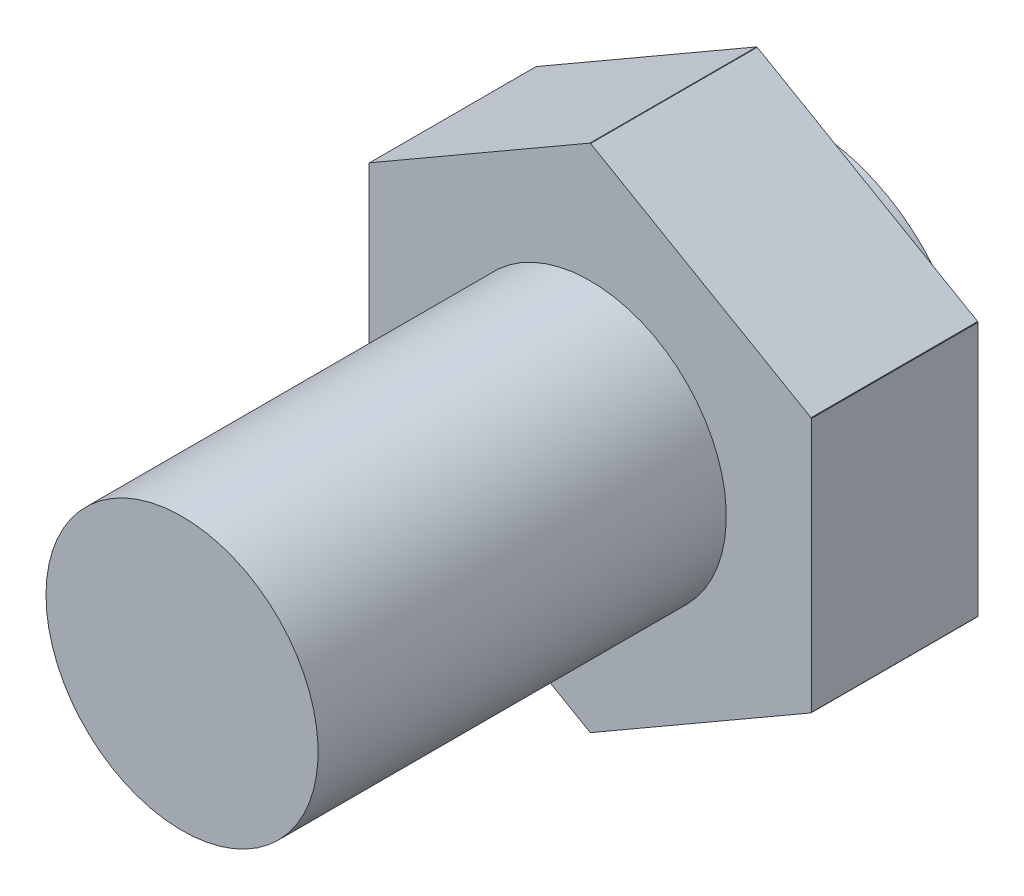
ISO-10303-21;
HEADER;
FILE_DESCRIPTION(('STEP AP214'),'2;1');
FILE_NAME('part.step','',(''),(''),'','','');
FILE_SCHEMA(('AUTOMOTIVE_DESIGN { 1 0 10303 214 1 1 1 1 }'));
ENDSEC;
DATA;
#1=APPLICATION_CONTEXT('core data for automotive mechanical design processes');
#2=APPLICATION_PROTOCOL_DEFINITION('international standard','automotive_design',2000,#1);
#3=PRODUCT_CONTEXT('',#1,'mechanical');
#4=PRODUCT('Part','Part','',(#3));
#5=PRODUCT_RELATED_PRODUCT_CATEGORY('part','',(#4));
#6=PRODUCT_DEFINITION_FORMATION('','',#4);
#7=PRODUCT_DEFINITION_CONTEXT('part definition',#1,'design');
#8=PRODUCT_DEFINITION('design','',#6,#7);
#9=PRODUCT_DEFINITION_SHAPE('','',#8);
#10=(LENGTH_UNIT() NAMED_UNIT(*) SI_UNIT(.MILLI.,.METRE.));
#11=(NAMED_UNIT(*) PLANE_ANGLE_UNIT() SI_UNIT($,.RADIAN.));
#12=(NAMED_UNIT(*) SI_UNIT($,.STERADIAN.) SOLID_ANGLE_UNIT());
#13=UNCERTAINTY_MEASURE_WITH_UNIT(LENGTH_MEASURE(1.E-05),#10,'distance_accuracy_value','');
#14=(GEOMETRIC_REPRESENTATION_CONTEXT(3) GLOBAL_UNCERTAINTY_ASSIGNED_CONTEXT((#13)) GLOBAL_UNIT_ASSIGNED_CONTEXT((#10,
#11,#12)) REPRESENTATION_CONTEXT('',''));
#15=CARTESIAN_POINT('',(0.,0.,0.));
#16=DIRECTION('',(0.,0.,1.));
#17=DIRECTION('',(1.,0.,0.));
#18=AXIS2_PLACEMENT_3D('',#15,#16,#17);
#19=CARTESIAN_POINT('',(-4.,0.,6.4));
#20=DIRECTION('',(0.,0.,-1.));
#21=DIRECTION('',(-1.,0.,0.));
#22=AXIS2_PLACEMENT_3D('',#19,#20,#21);
#23=PLANE('',#22);
#24=CARTESIAN_POINT('',(0.,0.,6.4));
#25=DIRECTION('',(0.,0.,-1.));
#26=DIRECTION('',(-1.,0.,0.));
#27=AXIS2_PLACEMENT_3D('',#24,#25,#26);
#28=CIRCLE('',#27,4.);
#29=CARTESIAN_POINT('',(-4.,0.,6.4));
#30=VERTEX_POINT('',#29);
#31=EDGE_CURVE('E131',#30,#30,#28,.T.);
#32=ORIENTED_EDGE('',*,*,#31,.T.);
#33=EDGE_LOOP('',(#32));
#34=FACE_BOUND('',#33,.T.);
#35=CARTESIAN_POINT('',(0.,0.,6.4));
#36=DIRECTION('',(0.,0.,-1.));
#37=DIRECTION('',(-1.,0.,0.));
#38=AXIS2_PLACEMENT_3D('',#35,#36,#37);
#39=CIRCLE('',#38,7.5);
#40=CARTESIAN_POINT('',(-0.00962965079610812,7.49999381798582,6.4));
#41=VERTEX_POINT('',#40);
#42=CARTESIAN_POINT('',(0.00962965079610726,7.49999381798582,6.4));
#43=VERTEX_POINT('',#42);
#44=EDGE_CURVE('E132',#41,#43,#39,.T.);
#45=ORIENTED_EDGE('',*,*,#44,.F.);
#46=DIRECTION('',(-0.866025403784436,-0.5,0.));
#47=VECTOR('',#46,1.);
#48=CARTESIAN_POINT('',(-6.25,3.89711431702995,6.4));
#49=LINE('',#48,#47);
#50=CARTESIAN_POINT('',(-6.49037034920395,3.75833643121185,6.4));
#51=VERTEX_POINT('',#50);
#52=EDGE_CURVE('E116',#41,#51,#49,.T.);
#53=ORIENTED_EDGE('',*,*,#52,.T.);
#54=CARTESIAN_POINT('',(-6.5,3.74165738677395,6.4));
#55=VERTEX_POINT('',#54);
#56=EDGE_CURVE('E128',#55,#51,#39,.T.);
#57=ORIENTED_EDGE('',*,*,#56,.F.);
#58=DIRECTION('',(0.,-1.,0.));
#59=VECTOR('',#58,1.);
#60=CARTESIAN_POINT('',(-6.5,0.,6.4));
#61=LINE('',#60,#59);
#62=CARTESIAN_POINT('',(-6.5,-3.74165738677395,6.4));
#63=VERTEX_POINT('',#62);
#64=EDGE_CURVE('E122',#55,#63,#61,.T.);
#65=ORIENTED_EDGE('',*,*,#64,.T.);
#66=CARTESIAN_POINT('',(-6.49037034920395,-3.75833643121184,6.4));
#67=VERTEX_POINT('',#66);
#68=EDGE_CURVE('E127',#67,#63,#39,.T.);
#69=ORIENTED_EDGE('',*,*,#68,.F.);
#70=DIRECTION('',(-0.866025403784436,0.5,0.));
#71=VECTOR('',#70,1.);
#72=CARTESIAN_POINT('',(-6.25,-3.89711431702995,6.4));
#73=LINE('',#72,#71);
#74=CARTESIAN_POINT('',(-0.00962965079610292,-7.49999381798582,6.4));
#75=VERTEX_POINT('',#74);
#76=EDGE_CURVE('E248',#75,#67,#73,.T.);
#77=ORIENTED_EDGE('',*,*,#76,.F.);
#78=CARTESIAN_POINT('',(0.00962965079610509,-7.49999381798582,6.4));
#79=VERTEX_POINT('',#78);
#80=EDGE_CURVE('E263',#79,#75,#39,.T.);
#81=ORIENTED_EDGE('',*,*,#80,.F.);
#82=DIRECTION('',(0.866025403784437,0.5,0.));
#83=VECTOR('',#82,1.);
#84=CARTESIAN_POINT('',(0.25000000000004,-7.36121593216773,6.4));
#85=LINE('',#84,#83);
#86=CARTESIAN_POINT('',(6.49037034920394,-3.75833643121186,6.4));
#87=VERTEX_POINT('',#86);
#88=EDGE_CURVE('E240',#79,#87,#85,.T.);
#89=ORIENTED_EDGE('',*,*,#88,.T.);
#90=CARTESIAN_POINT('',(6.5,-3.74165738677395,6.4));
#91=VERTEX_POINT('',#90);
#92=EDGE_CURVE('E265',#91,#87,#39,.T.);
#93=ORIENTED_EDGE('',*,*,#92,.F.);
#94=DIRECTION('',(0.,-1.,0.));
#95=VECTOR('',#94,1.);
#96=CARTESIAN_POINT('',(6.5,0.,6.4));
#97=LINE('',#96,#95);
#98=CARTESIAN_POINT('',(6.5,3.74165738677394,6.4));
#99=VERTEX_POINT('',#98);
#100=EDGE_CURVE('E233',#99,#91,#97,.T.);
#101=ORIENTED_EDGE('',*,*,#100,.F.);
#102=CARTESIAN_POINT('',(6.49037034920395,3.75833643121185,6.4));
#103=VERTEX_POINT('',#102);
#104=EDGE_CURVE('E270',#103,#99,#39,.T.);
#105=ORIENTED_EDGE('',*,*,#104,.F.);
#106=DIRECTION('',(0.866025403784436,-0.5,0.));
#107=VECTOR('',#106,1.);
#108=CARTESIAN_POINT('',(0.250000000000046,7.36121593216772,6.4));
#109=LINE('',#108,#107);
#110=EDGE_CURVE('E226',#43,#103,#109,.T.);
#111=ORIENTED_EDGE('',*,*,#110,.F.);
#112=EDGE_LOOP('',(#45,#53,#57,#65,#69,#77,#81,#89,#93,#101,#105,#111));
#113=FACE_BOUND('',#112,.T.);
#114=ADVANCED_FACE('F15',(#34,#113),#23,.F.);
#115=CARTESIAN_POINT('',(0.,0.,-51.6));
#116=DIRECTION('',(0.,0.,-1.));
#117=DIRECTION('',(-1.,0.,0.));
#118=AXIS2_PLACEMENT_3D('',#115,#116,#117);
#119=CYLINDRICAL_SURFACE('',#118,7.5);
#120=DIRECTION('',(0.,0.,-1.));
#121=VECTOR('',#120,1.);
#122=CARTESIAN_POINT('',(-6.49037034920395,3.75833643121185,-51.6));
#123=LINE('',#122,#121);
#124=CARTESIAN_POINT('',(-6.49037034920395,3.75833643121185,1.5));
#125=VERTEX_POINT('',#124);
#126=EDGE_CURVE('E37',#51,#125,#123,.T.);
#127=ORIENTED_EDGE('',*,*,#126,.T.);
#128=CARTESIAN_POINT('',(0.,0.,1.5));
#129=DIRECTION('',(0.,0.,1.));
#130=DIRECTION('',(1.,0.,0.));
#131=AXIS2_PLACEMENT_3D('',#128,#129,#130);
#132=CIRCLE('',#131,7.5);
#133=CARTESIAN_POINT('',(-6.5,3.74165738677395,1.5));
#134=VERTEX_POINT('',#133);
#135=EDGE_CURVE('E31',#125,#134,#132,.T.);
#136=ORIENTED_EDGE('',*,*,#135,.T.);
#137=DIRECTION('',(0.,0.,-1.));
#138=VECTOR('',#137,1.);
#139=CARTESIAN_POINT('',(-6.5,3.74165738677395,-51.6));
#140=LINE('',#139,#138);
#141=EDGE_CURVE('E253',#134,#55,#140,.F.);
#142=ORIENTED_EDGE('',*,*,#141,.T.);
#143=ORIENTED_EDGE('',*,*,#56,.T.);
#144=EDGE_LOOP('',(#127,#136,#142,#143));
#145=FACE_BOUND('',#144,.T.);
#146=ADVANCED_FACE('F152',(#145),#119,.T.);
#147=DIRECTION('',(0.,0.,-1.));
#148=VECTOR('',#147,1.);
#149=CARTESIAN_POINT('',(-6.5,-3.74165738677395,-51.6));
#150=LINE('',#149,#148);
#151=CARTESIAN_POINT('',(-6.5,-3.74165738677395,1.5));
#152=VERTEX_POINT('',#151);
#153=EDGE_CURVE('E118',#63,#152,#150,.T.);
#154=ORIENTED_EDGE('',*,*,#153,.T.);
#155=CARTESIAN_POINT('',(0.,0.,1.5));
#156=DIRECTION('',(0.,0.,1.));
#157=DIRECTION('',(1.,0.,0.));
#158=AXIS2_PLACEMENT_3D('',#155,#156,#157);
#159=CIRCLE('',#158,7.5);
#160=CARTESIAN_POINT('',(-6.49037034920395,-3.75833643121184,1.5));
#161=VERTEX_POINT('',#160);
#162=EDGE_CURVE('E209',#152,#161,#159,.T.);
#163=ORIENTED_EDGE('',*,*,#162,.T.);
#164=DIRECTION('',(0.,0.,-1.));
#165=VECTOR('',#164,1.);
#166=CARTESIAN_POINT('',(-6.49037034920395,-3.75833643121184,-51.6));
#167=LINE('',#166,#165);
#168=EDGE_CURVE('E250',#67,#161,#167,.T.);
#169=ORIENTED_EDGE('',*,*,#168,.F.);
#170=ORIENTED_EDGE('',*,*,#68,.T.);
#171=EDGE_LOOP('',(#154,#163,#169,#170));
#172=FACE_BOUND('',#171,.T.);
#173=ADVANCED_FACE('F159',(#172),#119,.T.);
#174=DIRECTION('',(0.,0.,-1.));
#175=VECTOR('',#174,1.);
#176=CARTESIAN_POINT('',(0.00962965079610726,7.49999381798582,-51.6));
#177=LINE('',#176,#175);
#178=CARTESIAN_POINT('',(0.00962965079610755,7.49999381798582,1.5));
#179=VERTEX_POINT('',#178);
#180=EDGE_CURVE('E112',#179,#43,#177,.F.);
#181=ORIENTED_EDGE('',*,*,#180,.F.);
#182=CARTESIAN_POINT('',(0.,0.,1.5));
#183=DIRECTION('',(0.,0.,1.));
#184=DIRECTION('',(1.,0.,0.));
#185=AXIS2_PLACEMENT_3D('',#182,#183,#184);
#186=CIRCLE('',#185,7.5);
#187=CARTESIAN_POINT('',(-0.00962965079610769,7.49999381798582,1.5));
#188=VERTEX_POINT('',#187);
#189=EDGE_CURVE('E104',#179,#188,#186,.T.);
#190=ORIENTED_EDGE('',*,*,#189,.T.);
#191=DIRECTION('',(0.,0.,-1.));
#192=VECTOR('',#191,1.);
#193=CARTESIAN_POINT('',(-0.00962965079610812,7.49999381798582,-51.6));
#194=LINE('',#193,#192);
#195=EDGE_CURVE('E111',#188,#41,#194,.F.);
#196=ORIENTED_EDGE('',*,*,#195,.T.);
#197=ORIENTED_EDGE('',*,*,#44,.T.);
#198=EDGE_LOOP('',(#181,#190,#196,#197));
#199=FACE_BOUND('',#198,.T.);
#200=ADVANCED_FACE('F109',(#199),#119,.T.);
#201=DIRECTION('',(0.,0.,-1.));
#202=VECTOR('',#201,1.);
#203=CARTESIAN_POINT('',(-0.00962965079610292,-7.49999381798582,-51.6));
#204=LINE('',#203,#202);
#205=CARTESIAN_POINT('',(-0.00962965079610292,-7.49999381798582,1.5));
#206=VERTEX_POINT('',#205);
#207=EDGE_CURVE('E246',#206,#75,#204,.F.);
#208=ORIENTED_EDGE('',*,*,#207,.F.);
#209=CARTESIAN_POINT('',(0.,0.,1.5));
#210=DIRECTION('',(0.,0.,1.));
#211=DIRECTION('',(1.,0.,0.));
#212=AXIS2_PLACEMENT_3D('',#209,#210,#211);
#213=CIRCLE('',#212,7.5);
#214=CARTESIAN_POINT('',(0.00962965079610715,-7.49999381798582,1.5));
#215=VERTEX_POINT('',#214);
#216=EDGE_CURVE('E219',#206,#215,#213,.T.);
#217=ORIENTED_EDGE('',*,*,#216,.T.);
#218=DIRECTION('',(0.,0.,-1.));
#219=VECTOR('',#218,1.);
#220=CARTESIAN_POINT('',(0.00962965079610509,-7.49999381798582,-51.6));
#221=LINE('',#220,#219);
#222=EDGE_CURVE('E238',#215,#79,#221,.F.);
#223=ORIENTED_EDGE('',*,*,#222,.T.);
#224=ORIENTED_EDGE('',*,*,#80,.T.);
#225=EDGE_LOOP('',(#208,#217,#223,#224));
#226=FACE_BOUND('',#225,.T.);
#227=ADVANCED_FACE('F284',(#226),#119,.T.);
#228=DIRECTION('',(0.,0.,-1.));
#229=VECTOR('',#228,1.);
#230=CARTESIAN_POINT('',(6.49037034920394,-3.75833643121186,-51.6));
#231=LINE('',#230,#229);
#232=CARTESIAN_POINT('',(6.49037034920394,-3.75833643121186,1.5));
#233=VERTEX_POINT('',#232);
#234=EDGE_CURVE('E243',#87,#233,#231,.T.);
#235=ORIENTED_EDGE('',*,*,#234,.T.);
#236=CARTESIAN_POINT('',(0.,0.,1.5));
#237=DIRECTION('',(0.,0.,1.));
#238=DIRECTION('',(1.,0.,0.));
#239=AXIS2_PLACEMENT_3D('',#236,#237,#238);
#240=CIRCLE('',#239,7.5);
#241=CARTESIAN_POINT('',(6.5,-3.74165738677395,1.5));
#242=VERTEX_POINT('',#241);
#243=EDGE_CURVE('E216',#233,#242,#240,.T.);
#244=ORIENTED_EDGE('',*,*,#243,.T.);
#245=DIRECTION('',(0.,0.,-1.));
#246=VECTOR('',#245,1.);
#247=CARTESIAN_POINT('',(6.5,-3.74165738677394,-51.6));
#248=LINE('',#247,#246);
#249=EDGE_CURVE('E235',#91,#242,#248,.T.);
#250=ORIENTED_EDGE('',*,*,#249,.F.);
#251=ORIENTED_EDGE('',*,*,#92,.T.);
#252=EDGE_LOOP('',(#235,#244,#250,#251));
#253=FACE_BOUND('',#252,.T.);
#254=ADVANCED_FACE('F149',(#253),#119,.T.);
#255=DIRECTION('',(0.,0.,-1.));
#256=VECTOR('',#255,1.);
#257=CARTESIAN_POINT('',(6.5,3.74165738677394,-51.6));
#258=LINE('',#257,#256);
#259=CARTESIAN_POINT('',(6.5,3.74165738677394,1.5));
#260=VERTEX_POINT('',#259);
#261=EDGE_CURVE('E231',#260,#99,#258,.F.);
#262=ORIENTED_EDGE('',*,*,#261,.F.);
#263=CARTESIAN_POINT('',(0.,0.,1.5));
#264=DIRECTION('',(0.,0.,1.));
#265=DIRECTION('',(1.,0.,0.));
#266=AXIS2_PLACEMENT_3D('',#263,#264,#265);
#267=CIRCLE('',#266,7.5);
#268=CARTESIAN_POINT('',(6.49037034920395,3.75833643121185,1.5));
#269=VERTEX_POINT('',#268);
#270=EDGE_CURVE('E206',#260,#269,#267,.T.);
#271=ORIENTED_EDGE('',*,*,#270,.T.);
#272=DIRECTION('',(0.,0.,-1.));
#273=VECTOR('',#272,1.);
#274=CARTESIAN_POINT('',(6.49037034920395,3.75833643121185,-51.6));
#275=LINE('',#274,#273);
#276=EDGE_CURVE('E228',#103,#269,#275,.T.);
#277=ORIENTED_EDGE('',*,*,#276,.F.);
#278=ORIENTED_EDGE('',*,*,#104,.T.);
#279=EDGE_LOOP('',(#262,#271,#277,#278));
#280=FACE_BOUND('',#279,.T.);
#281=ADVANCED_FACE('F141',(#280),#119,.T.);
#282=CARTESIAN_POINT('',(0.,0.,18.4));
#283=DIRECTION('',(0.,0.,-1.));
#284=DIRECTION('',(-1.,0.,0.));
#285=AXIS2_PLACEMENT_3D('',#282,#283,#284);
#286=PLANE('',#285);
#287=CARTESIAN_POINT('',(0.,0.,18.4));
#288=DIRECTION('',(0.,0.,-1.));
#289=DIRECTION('',(-1.,0.,0.));
#290=AXIS2_PLACEMENT_3D('',#287,#288,#289);
#291=CIRCLE('',#290,4.);
#292=CARTESIAN_POINT('',(-4.,0.,18.4));
#293=VERTEX_POINT('',#292);
#294=EDGE_CURVE('E24',#293,#293,#291,.T.);
#295=ORIENTED_EDGE('',*,*,#294,.F.);
#296=EDGE_LOOP('',(#295));
#297=FACE_BOUND('',#296,.T.);
#298=ADVANCED_FACE('F17',(#297),#286,.F.);
#299=CARTESIAN_POINT('',(0.,0.,-51.6));
#300=DIRECTION('',(0.,0.,-1.));
#301=DIRECTION('',(-1.,0.,0.));
#302=AXIS2_PLACEMENT_3D('',#299,#300,#301);
#303=CYLINDRICAL_SURFACE('',#302,4.);
#304=ORIENTED_EDGE('',*,*,#31,.F.);
#305=EDGE_LOOP('',(#304));
#306=FACE_BOUND('',#305,.T.);
#307=ORIENTED_EDGE('',*,*,#294,.T.);
#308=EDGE_LOOP('',(#307));
#309=FACE_BOUND('',#308,.T.);
#310=ADVANCED_FACE('F138',(#306,#309),#303,.T.);
#311=CARTESIAN_POINT('',(0.,7.50555349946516,10.));
#312=DIRECTION('',(0.5,0.866025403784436,0.));
#313=DIRECTION('',(0.866025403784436,-0.5,0.));
#314=AXIS2_PLACEMENT_3D('',#311,#312,#313);
#315=PLANE('',#314);
#316=DIRECTION('',(0.866025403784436,-0.5,0.));
#317=VECTOR('',#316,1.);
#318=CARTESIAN_POINT('',(0.,7.50555349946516,1.5));
#319=LINE('',#318,#317);
#320=EDGE_CURVE('E204',#179,#269,#319,.T.);
#321=ORIENTED_EDGE('',*,*,#320,.F.);
#322=ORIENTED_EDGE('',*,*,#180,.T.);
#323=ORIENTED_EDGE('',*,*,#110,.T.);
#324=ORIENTED_EDGE('',*,*,#276,.T.);
#325=EDGE_LOOP('',(#321,#322,#323,#324));
#326=FACE_BOUND('',#325,.T.);
#327=ADVANCED_FACE('F147',(#326),#315,.T.);
#328=CARTESIAN_POINT('',(6.5,3.75277674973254,10.));
#329=DIRECTION('',(1.,0.,0.));
#330=DIRECTION('',(0.,0.,-1.));
#331=AXIS2_PLACEMENT_3D('',#328,#329,#330);
#332=PLANE('',#331);
#333=DIRECTION('',(0.,-1.,0.));
#334=VECTOR('',#333,1.);
#335=CARTESIAN_POINT('',(6.5,3.75277674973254,1.5));
#336=LINE('',#335,#334);
#337=EDGE_CURVE('E214',#260,#242,#336,.T.);
#338=ORIENTED_EDGE('',*,*,#337,.F.);
#339=ORIENTED_EDGE('',*,*,#261,.T.);
#340=ORIENTED_EDGE('',*,*,#100,.T.);
#341=ORIENTED_EDGE('',*,*,#249,.T.);
#342=EDGE_LOOP('',(#338,#339,#340,#341));
#343=FACE_BOUND('',#342,.T.);
#344=ADVANCED_FACE('F178',(#343),#332,.T.);
#345=CARTESIAN_POINT('',(0.,-7.50555349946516,10.));
#346=DIRECTION('',(-0.5,0.866025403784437,0.));
#347=DIRECTION('',(0.866025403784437,0.5,0.));
#348=AXIS2_PLACEMENT_3D('',#345,#346,#347);
#349=PLANE('',#348);
#350=ORIENTED_EDGE('',*,*,#222,.F.);
#351=DIRECTION('',(0.866025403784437,0.5,0.));
#352=VECTOR('',#351,1.);
#353=CARTESIAN_POINT('',(0.,-7.50555349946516,1.5));
#354=LINE('',#353,#352);
#355=EDGE_CURVE('E222',#215,#233,#354,.T.);
#356=ORIENTED_EDGE('',*,*,#355,.T.);
#357=ORIENTED_EDGE('',*,*,#234,.F.);
#358=ORIENTED_EDGE('',*,*,#88,.F.);
#359=EDGE_LOOP('',(#350,#356,#357,#358));
#360=FACE_BOUND('',#359,.T.);
#361=ADVANCED_FACE('F174',(#360),#349,.F.);
#362=CARTESIAN_POINT('',(0.,-7.50555349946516,10.));
#363=DIRECTION('',(-0.5,-0.866025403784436,0.));
#364=DIRECTION('',(-0.866025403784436,0.5,0.));
#365=AXIS2_PLACEMENT_3D('',#362,#363,#364);
#366=PLANE('',#365);
#367=DIRECTION('',(-0.866025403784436,0.5,0.));
#368=VECTOR('',#367,1.);
#369=CARTESIAN_POINT('',(0.,-7.50555349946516,1.5));
#370=LINE('',#369,#368);
#371=EDGE_CURVE('E212',#206,#161,#370,.T.);
#372=ORIENTED_EDGE('',*,*,#371,.F.);
#373=ORIENTED_EDGE('',*,*,#207,.T.);
#374=ORIENTED_EDGE('',*,*,#76,.T.);
#375=ORIENTED_EDGE('',*,*,#168,.T.);
#376=EDGE_LOOP('',(#372,#373,#374,#375));
#377=FACE_BOUND('',#376,.T.);
#378=ADVANCED_FACE('F170',(#377),#366,.T.);
#379=CARTESIAN_POINT('',(-6.5,3.75277674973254,10.));
#380=DIRECTION('',(1.,0.,0.));
#381=DIRECTION('',(0.,-1.,0.));
#382=AXIS2_PLACEMENT_3D('',#379,#380,#381);
#383=PLANE('',#382);
#384=ORIENTED_EDGE('',*,*,#141,.F.);
#385=DIRECTION('',(0.,-1.,0.));
#386=VECTOR('',#385,1.);
#387=CARTESIAN_POINT('',(-6.5,3.75277674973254,1.5));
#388=LINE('',#387,#386);
#389=EDGE_CURVE('E201',#134,#152,#388,.T.);
#390=ORIENTED_EDGE('',*,*,#389,.T.);
#391=ORIENTED_EDGE('',*,*,#153,.F.);
#392=ORIENTED_EDGE('',*,*,#64,.F.);
#393=EDGE_LOOP('',(#384,#390,#391,#392));
#394=FACE_BOUND('',#393,.T.);
#395=ADVANCED_FACE('F167',(#394),#383,.F.);
#396=CARTESIAN_POINT('',(0.,7.50555349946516,10.));
#397=DIRECTION('',(0.5,-0.866025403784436,0.));
#398=DIRECTION('',(-0.866025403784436,-0.5,0.));
#399=AXIS2_PLACEMENT_3D('',#396,#397,#398);
#400=PLANE('',#399);
#401=ORIENTED_EDGE('',*,*,#195,.F.);
#402=DIRECTION('',(-0.866025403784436,-0.5,0.));
#403=VECTOR('',#402,1.);
#404=CARTESIAN_POINT('',(0.,7.50555349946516,1.5));
#405=LINE('',#404,#403);
#406=EDGE_CURVE('E9',#188,#125,#405,.T.);
#407=ORIENTED_EDGE('',*,*,#406,.T.);
#408=ORIENTED_EDGE('',*,*,#126,.F.);
#409=ORIENTED_EDGE('',*,*,#52,.F.);
#410=EDGE_LOOP('',(#401,#407,#408,#409));
#411=FACE_BOUND('',#410,.T.);
#412=ADVANCED_FACE('F115',(#411),#400,.F.);
#413=CARTESIAN_POINT('',(0.,0.,-21.6));
#414=DIRECTION('',(0.,0.,-1.));
#415=DIRECTION('',(-1.,0.,0.));
#416=AXIS2_PLACEMENT_3D('',#413,#414,#415);
#417=CYLINDRICAL_SURFACE('',#416,4.75);
#418=CARTESIAN_POINT('',(0.,0.,1.5));
#419=DIRECTION('',(0.,0.,-1.));
#420=DIRECTION('',(-1.,0.,0.));
#421=AXIS2_PLACEMENT_3D('',#418,#419,#420);
#422=CIRCLE('',#421,4.75);
#423=CARTESIAN_POINT('',(-4.75,0.,1.5));
#424=VERTEX_POINT('',#423);
#425=EDGE_CURVE('E113',#424,#424,#422,.T.);
#426=ORIENTED_EDGE('',*,*,#425,.T.);
#427=EDGE_LOOP('',(#426));
#428=FACE_BOUND('',#427,.T.);
#429=CARTESIAN_POINT('',(0.,0.,0.));
#430=DIRECTION('',(0.,0.,1.));
#431=DIRECTION('',(1.,0.,0.));
#432=AXIS2_PLACEMENT_3D('',#429,#430,#431);
#433=CIRCLE('',#432,4.75);
#434=CARTESIAN_POINT('',(4.75,0.,0.));
#435=VERTEX_POINT('',#434);
#436=EDGE_CURVE('E19',#435,#435,#433,.T.);
#437=ORIENTED_EDGE('',*,*,#436,.T.);
#438=EDGE_LOOP('',(#437));
#439=FACE_BOUND('',#438,.T.);
#440=ADVANCED_FACE('F188',(#428,#439),#417,.T.);
#441=CARTESIAN_POINT('',(0.,11.4999999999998,1.5));
#442=DIRECTION('',(0.,0.,1.));
#443=DIRECTION('',(1.,0.,0.));
#444=AXIS2_PLACEMENT_3D('',#441,#442,#443);
#445=PLANE('',#444);
#446=ORIENTED_EDGE('',*,*,#425,.F.);
#447=EDGE_LOOP('',(#446));
#448=FACE_BOUND('',#447,.T.);
#449=ORIENTED_EDGE('',*,*,#216,.F.);
#450=ORIENTED_EDGE('',*,*,#371,.T.);
#451=ORIENTED_EDGE('',*,*,#162,.F.);
#452=ORIENTED_EDGE('',*,*,#389,.F.);
#453=ORIENTED_EDGE('',*,*,#135,.F.);
#454=ORIENTED_EDGE('',*,*,#406,.F.);
#455=ORIENTED_EDGE('',*,*,#189,.F.);
#456=ORIENTED_EDGE('',*,*,#320,.T.);
#457=ORIENTED_EDGE('',*,*,#270,.F.);
#458=ORIENTED_EDGE('',*,*,#337,.T.);
#459=ORIENTED_EDGE('',*,*,#243,.F.);
#460=ORIENTED_EDGE('',*,*,#355,.F.);
#461=EDGE_LOOP('',(#449,#450,#451,#452,#453,#454,#455,#456,#457,#458,#459,#460));
#462=FACE_BOUND('',#461,.T.);
#463=ADVANCED_FACE('F103',(#448,#462),#445,.F.);
#464=CARTESIAN_POINT('',(-7.5,0.,0.));
#465=DIRECTION('',(0.,0.,1.));
#466=DIRECTION('',(1.,0.,0.));
#467=AXIS2_PLACEMENT_3D('',#464,#465,#466);
#468=PLANE('',#467);
#469=ORIENTED_EDGE('',*,*,#436,.F.);
#470=EDGE_LOOP('',(#469));
#471=FACE_BOUND('',#470,.T.);
#472=ADVANCED_FACE('F163',(#471),#468,.F.);
#473=CLOSED_SHELL('',(#114,#146,#173,#200,#227,#254,#281,#298,#310,#327,#344,#361,#378,#395,
#412,#440,#463,#472));
#474=MANIFOLD_SOLID_BREP('B1',#473);
#475=ADVANCED_BREP_SHAPE_REPRESENTATION('',(#18,#474),#14);
#476=SHAPE_DEFINITION_REPRESENTATION(#9,#475);
ENDSEC;
END-ISO-10303-21;
